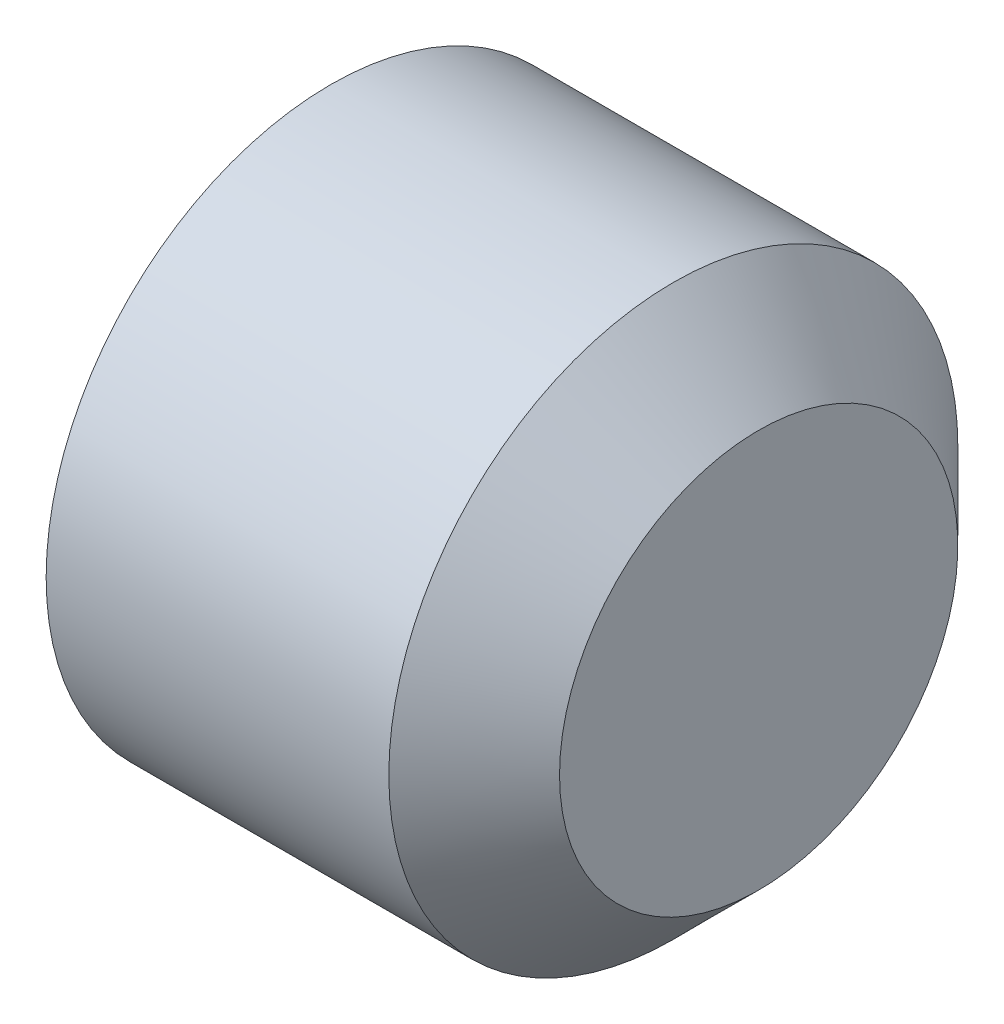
from build123d import *

# Parameters (mm, degrees)
HEX_2_DEPTH = 4


with BuildPart() as part:
    # BodySke → BaseBody (revolve)
    with BuildSketch(Plane.XY, mode=Mode.PRIVATE) as basebody_sk:
        Polygon((0, 0), (0, 4.172), (0.478046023, 5), (6.5, 5), (8, 3.5), (8, 0), align=None)
    revolve(basebody_sk.sketch.rotate(Axis((-12.7, 0, 0), (1, 0, 0)), 90), axis=Axis((-12.7, 0, 0), (1, 0, 0)))

    # Sketch2 → Hex 2 (cut)
    with BuildSketch(Plane.ZY):
        Polygon((1.443375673, 2.5), (-1.443375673, 2.5), (-2.886751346, 0), (-1.443375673, -2.5), (1.443375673, -2.5), (2.886751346, 0), align=None)
    extrude(amount=-HEX_2_DEPTH, mode=Mode.SUBTRACT)


solid = part.part
